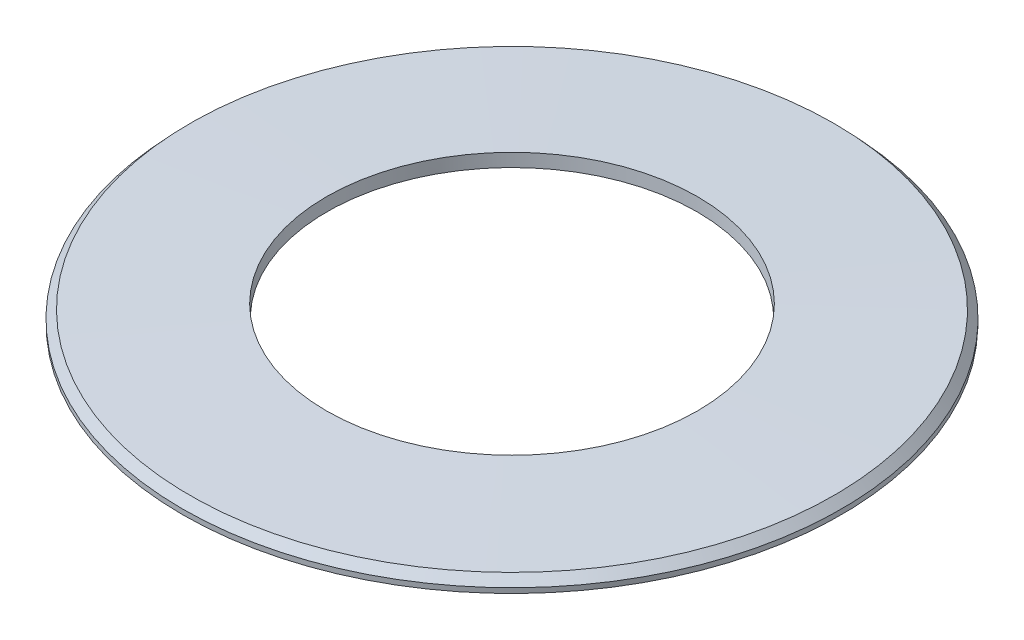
ISO-10303-21;
HEADER;
FILE_DESCRIPTION(('STEP AP214'),'2;1');
FILE_NAME('part.step','',(''),(''),'','','');
FILE_SCHEMA(('AUTOMOTIVE_DESIGN { 1 0 10303 214 1 1 1 1 }'));
ENDSEC;
DATA;
#1=APPLICATION_CONTEXT('core data for automotive mechanical design processes');
#2=APPLICATION_PROTOCOL_DEFINITION('international standard','automotive_design',2000,#1);
#3=PRODUCT_CONTEXT('',#1,'mechanical');
#4=PRODUCT('Part','Part','',(#3));
#5=PRODUCT_RELATED_PRODUCT_CATEGORY('part','',(#4));
#6=PRODUCT_DEFINITION_FORMATION('','',#4);
#7=PRODUCT_DEFINITION_CONTEXT('part definition',#1,'design');
#8=PRODUCT_DEFINITION('design','',#6,#7);
#9=PRODUCT_DEFINITION_SHAPE('','',#8);
#10=(LENGTH_UNIT() NAMED_UNIT(*) SI_UNIT(.MILLI.,.METRE.));
#11=(NAMED_UNIT(*) PLANE_ANGLE_UNIT() SI_UNIT($,.RADIAN.));
#12=(NAMED_UNIT(*) SI_UNIT($,.STERADIAN.) SOLID_ANGLE_UNIT());
#13=UNCERTAINTY_MEASURE_WITH_UNIT(LENGTH_MEASURE(1.E-05),#10,'distance_accuracy_value','');
#14=(GEOMETRIC_REPRESENTATION_CONTEXT(3) GLOBAL_UNCERTAINTY_ASSIGNED_CONTEXT((#13)) GLOBAL_UNIT_ASSIGNED_CONTEXT((#10,
#11,#12)) REPRESENTATION_CONTEXT('',''));
#15=CARTESIAN_POINT('',(0.,0.,0.));
#16=DIRECTION('',(0.,0.,1.));
#17=DIRECTION('',(1.,0.,0.));
#18=AXIS2_PLACEMENT_3D('',#15,#16,#17);
#19=CARTESIAN_POINT('',(0.,0.0999360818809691,0.));
#20=DIRECTION('',(0.,-1.,0.));
#21=DIRECTION('',(0.,0.,-1.));
#22=AXIS2_PLACEMENT_3D('',#19,#20,#21);
#23=CONICAL_SURFACE('',#22,6.39463772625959,0.749642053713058);
#24=CARTESIAN_POINT('',(0.,0.255202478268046,0.));
#25=DIRECTION('',(0.,-1.,0.));
#26=DIRECTION('',(0.,0.,-1.));
#27=AXIS2_PLACEMENT_3D('',#24,#25,#26);
#28=CIRCLE('',#27,6.2500958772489);
#29=CARTESIAN_POINT('',(0.,0.255202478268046,-6.2500958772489));
#30=VERTEX_POINT('',#29);
#31=EDGE_CURVE('E17',#30,#30,#28,.F.);
#32=ORIENTED_EDGE('',*,*,#31,.F.);
#33=EDGE_LOOP('',(#32));
#34=FACE_BOUND('',#33,.T.);
#35=CARTESIAN_POINT('',(0.,0.0999360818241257,0.));
#36=DIRECTION('',(0.,1.,0.));
#37=DIRECTION('',(0.,0.,1.));
#38=AXIS2_PLACEMENT_3D('',#35,#36,#37);
#39=CIRCLE('',#38,6.3946377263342);
#40=CARTESIAN_POINT('',(0.,0.0999360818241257,6.3946377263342));
#41=VERTEX_POINT('',#40);
#42=EDGE_CURVE('E30',#41,#41,#39,.F.);
#43=ORIENTED_EDGE('',*,*,#42,.F.);
#44=EDGE_LOOP('',(#43));
#45=FACE_BOUND('',#44,.T.);
#46=ADVANCED_FACE('F14',(#34,#45),#23,.T.);
#47=CARTESIAN_POINT('',(0.,0.255202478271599,0.));
#48=DIRECTION('',(0.,-1.,0.));
#49=DIRECTION('',(0.,0.,-1.));
#50=AXIS2_PLACEMENT_3D('',#47,#48,#49);
#51=CONICAL_SURFACE('',#50,6.25009587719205,1.53504021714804);
#52=CARTESIAN_POINT('',(0.,0.35000000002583,0.));
#53=DIRECTION('',(0.,1.,0.));
#54=DIRECTION('',(0.,0.,1.));
#55=AXIS2_PLACEMENT_3D('',#52,#53,#54);
#56=CIRCLE('',#55,3.60000000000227);
#57=CARTESIAN_POINT('',(0.,0.35000000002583,3.60000000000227));
#58=VERTEX_POINT('',#57);
#59=EDGE_CURVE('E26',#58,#58,#56,.F.);
#60=ORIENTED_EDGE('',*,*,#59,.T.);
#61=EDGE_LOOP('',(#60));
#62=FACE_BOUND('',#61,.T.);
#63=ORIENTED_EDGE('',*,*,#31,.T.);
#64=EDGE_LOOP('',(#63));
#65=FACE_BOUND('',#64,.T.);
#66=ADVANCED_FACE('F37',(#62,#65),#51,.T.);
#67=CARTESIAN_POINT('',(0.,0.0999360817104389,0.));
#68=DIRECTION('',(0.,1.,0.));
#69=DIRECTION('',(0.,0.,1.));
#70=AXIS2_PLACEMENT_3D('',#67,#68,#69);
#71=CONICAL_SURFACE('',#70,6.39463772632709,0.0357561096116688);
#72=CARTESIAN_POINT('',(0.,-3.5527136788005E-12,0.));
#73=DIRECTION('',(0.,-1.,0.));
#74=DIRECTION('',(0.,0.,-1.));
#75=AXIS2_PLACEMENT_3D('',#72,#73,#74);
#76=CIRCLE('',#75,6.39106287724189);
#77=CARTESIAN_POINT('',(0.,-3.5527136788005E-12,-6.39106287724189));
#78=VERTEX_POINT('',#77);
#79=EDGE_CURVE('E21',#78,#78,#76,.F.);
#80=ORIENTED_EDGE('',*,*,#79,.T.);
#81=EDGE_LOOP('',(#80));
#82=FACE_BOUND('',#81,.T.);
#83=ORIENTED_EDGE('',*,*,#42,.T.);
#84=EDGE_LOOP('',(#83));
#85=FACE_BOUND('',#84,.T.);
#86=ADVANCED_FACE('F45',(#82,#85),#71,.T.);
#87=CARTESIAN_POINT('',(0.,0.350000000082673,0.));
#88=DIRECTION('',(0.,1.,0.));
#89=DIRECTION('',(0.,0.,1.));
#90=AXIS2_PLACEMENT_3D('',#87,#88,#89);
#91=CONICAL_SURFACE('',#90,3.60000000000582,0.0357561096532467);
#92=CARTESIAN_POINT('',(0.,0.100159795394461,0.));
#93=DIRECTION('',(0.,-1.,0.));
#94=DIRECTION('',(0.,0.,-1.));
#95=AXIS2_PLACEMENT_3D('',#92,#93,#94);
#96=CIRCLE('',#95,3.59106287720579);
#97=CARTESIAN_POINT('',(0.,0.100159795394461,-3.59106287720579));
#98=VERTEX_POINT('',#97);
#99=EDGE_CURVE('E10',#98,#98,#96,.T.);
#100=ORIENTED_EDGE('',*,*,#99,.T.);
#101=EDGE_LOOP('',(#100));
#102=FACE_BOUND('',#101,.T.);
#103=ORIENTED_EDGE('',*,*,#59,.F.);
#104=EDGE_LOOP('',(#103));
#105=FACE_BOUND('',#104,.T.);
#106=ADVANCED_FACE('F49',(#102,#105),#91,.F.);
#107=CARTESIAN_POINT('',(0.,3.5527136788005E-12,0.));
#108=DIRECTION('',(0.,-1.,0.));
#109=DIRECTION('',(0.,0.,-1.));
#110=AXIS2_PLACEMENT_3D('',#107,#108,#109);
#111=CONICAL_SURFACE('',#110,6.39106287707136,1.53504021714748);
#112=ORIENTED_EDGE('',*,*,#79,.F.);
#113=EDGE_LOOP('',(#112));
#114=FACE_BOUND('',#113,.T.);
#115=ORIENTED_EDGE('',*,*,#99,.F.);
#116=EDGE_LOOP('',(#115));
#117=FACE_BOUND('',#116,.T.);
#118=ADVANCED_FACE('F47',(#114,#117),#111,.F.);
#119=CLOSED_SHELL('',(#46,#66,#86,#106,#118));
#120=MANIFOLD_SOLID_BREP('B1',#119);
#121=ADVANCED_BREP_SHAPE_REPRESENTATION('',(#18,#120),#14);
#122=SHAPE_DEFINITION_REPRESENTATION(#9,#121);
ENDSEC;
END-ISO-10303-21;
